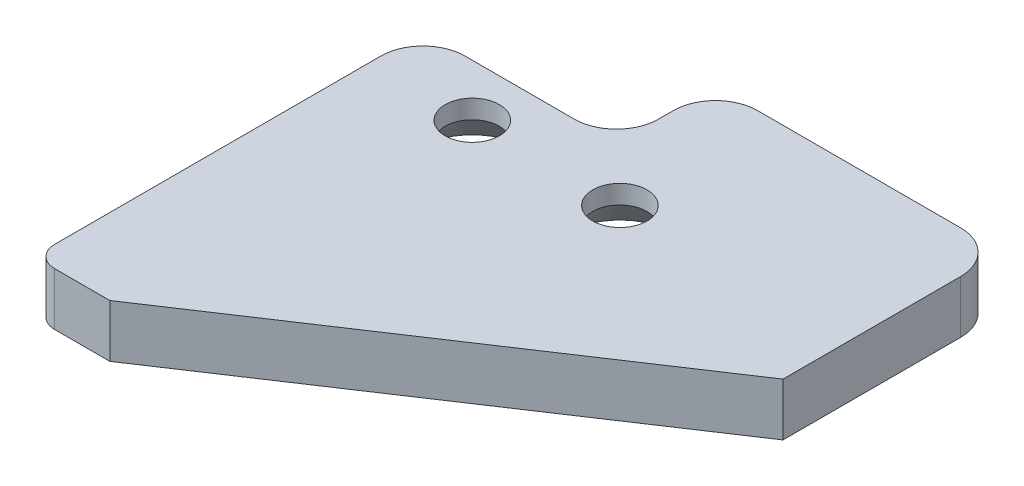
from build123d import *

# Parameters (mm, degrees)
BOSS_EXTRUDE1_DEPTH                           = 3.175
CSK_FOR_4_FLAT_HEAD_MACHINE_SCREW1_AT_2_COUNT = 2
CSK_FOR_4_FLAT_HEAD_MACHINE_SCREW1_AT_2_PITCH = 8.89
FILLET1_R                                     = 2.54
FILLET2_R                                     = 2.54
FILLET3_R                                     = 2.54
FILLET4_R                                     = 2.54
FILLET5_R                                     = 1.27


with BuildPart() as part:
    # Sketch1 → Boss-Extrude1 (new body)
    with BuildSketch(Plane(origin=(0, 0, 0), x_dir=(1, 0, 0), z_dir=(0, 1, 0))):
        Polygon((15.550263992, 12.540537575), (15.550263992, -0.699540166), (-8.823759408, -16.873688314), (-13.414081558, -16.873688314), (-13.414081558, 6.576488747), (-1.759864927, 6.576488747), (-1.759864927, 12.540537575), align=None)
    extrude(amount=BOSS_EXTRUDE1_DEPTH)

    # Sketch3 → CSK for _4 Flat Head Machine Screw1 (revolve, cut)
    with BuildSketch(Plane(origin=(-7.309736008, 0, -3.446311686), x_dir=(0, 0, -1), z_dir=(1, 0, 0))):
        Polygon((0, 0), (0, 3.175), (1.63195, 3.175), (1.63195, 2.044843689), (3.4095055, 0), align=None)
    csk_for_4_flat_head_machine_screw1 = revolve(axis=Axis((-7.309736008, -6.35, -3.446311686), (0, 1, 0)), mode=Mode.SUBTRACT)

    # CSK for _4 Flat Head Machine Screw1 at 2: CSK for _4 Flat Head Machine Screw1 ×2
    with Locations(*[(i * CSK_FOR_4_FLAT_HEAD_MACHINE_SCREW1_AT_2_PITCH, 0, 0) for i in range(1, CSK_FOR_4_FLAT_HEAD_MACHINE_SCREW1_AT_2_COUNT)]):
        add(csk_for_4_flat_head_machine_screw1, mode=Mode.SUBTRACT)

    # Fillet1
    fillet1_edges = [part.edges().sort_by_distance(p)[0] for p in [
        (-1.759864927, 1.5875, -12.540537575),
    ]]
    fillet(fillet1_edges, radius=FILLET1_R)

    # Fillet2
    fillet2_edges = [part.edges().sort_by_distance(p)[0] for p in [
        (-1.759864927, 1.5875, -6.576488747),
    ]]
    fillet(fillet2_edges, radius=FILLET2_R)

    # Fillet3
    fillet3_edges = [part.edges().sort_by_distance(p)[0] for p in [
        (15.550263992, 1.5875, -12.540537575),
    ]]
    fillet(fillet3_edges, radius=FILLET3_R)

    # Fillet4
    fillet4_edges = [part.edges().sort_by_distance(p)[0] for p in [
        (-13.414081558, 1.5875, -6.576488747),
    ]]
    fillet(fillet4_edges, radius=FILLET4_R)

    # Fillet5
    fillet5_edges = [part.edges().sort_by_distance(p)[0] for p in [
        (-13.414081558, 1.5875, 16.873688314),
    ]]
    fillet(fillet5_edges, radius=FILLET5_R)


solid = part.part
